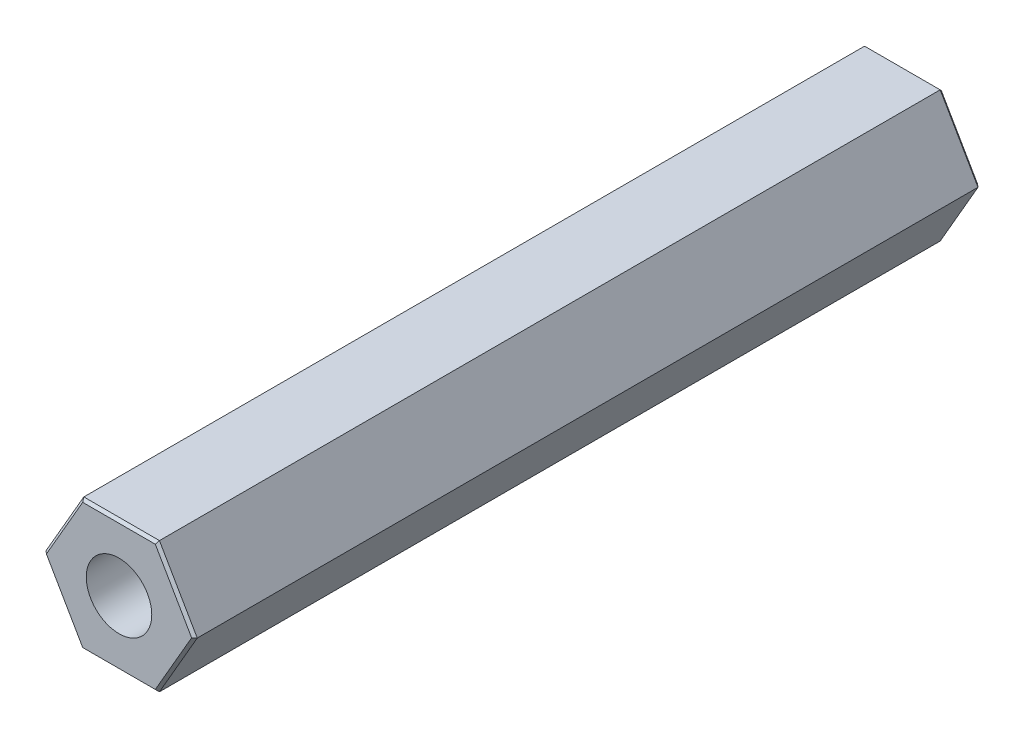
ISO-10303-21;
HEADER;
FILE_DESCRIPTION(('STEP AP214'),'2;1');
FILE_NAME('part.step','',(''),(''),'','','');
FILE_SCHEMA(('AUTOMOTIVE_DESIGN { 1 0 10303 214 1 1 1 1 }'));
ENDSEC;
DATA;
#1=APPLICATION_CONTEXT('core data for automotive mechanical design processes');
#2=APPLICATION_PROTOCOL_DEFINITION('international standard','automotive_design',2000,#1);
#3=PRODUCT_CONTEXT('',#1,'mechanical');
#4=PRODUCT('Part','Part','',(#3));
#5=PRODUCT_RELATED_PRODUCT_CATEGORY('part','',(#4));
#6=PRODUCT_DEFINITION_FORMATION('','',#4);
#7=PRODUCT_DEFINITION_CONTEXT('part definition',#1,'design');
#8=PRODUCT_DEFINITION('design','',#6,#7);
#9=PRODUCT_DEFINITION_SHAPE('','',#8);
#10=(LENGTH_UNIT() NAMED_UNIT(*) SI_UNIT(.MILLI.,.METRE.));
#11=(NAMED_UNIT(*) PLANE_ANGLE_UNIT() SI_UNIT($,.RADIAN.));
#12=(NAMED_UNIT(*) SI_UNIT($,.STERADIAN.) SOLID_ANGLE_UNIT());
#13=UNCERTAINTY_MEASURE_WITH_UNIT(LENGTH_MEASURE(1.E-05),#10,'distance_accuracy_value','');
#14=(GEOMETRIC_REPRESENTATION_CONTEXT(3) GLOBAL_UNCERTAINTY_ASSIGNED_CONTEXT((#13)) GLOBAL_UNIT_ASSIGNED_CONTEXT((#10,
#11,#12)) REPRESENTATION_CONTEXT('',''));
#15=CARTESIAN_POINT('',(0.,0.,0.));
#16=DIRECTION('',(0.,0.,1.));
#17=DIRECTION('',(1.,0.,0.));
#18=AXIS2_PLACEMENT_3D('',#15,#16,#17);
#19=CARTESIAN_POINT('',(2.88675134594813,0.,30.));
#20=DIRECTION('',(-0.866025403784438,-0.5,0.));
#21=DIRECTION('',(0.5,-0.866025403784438,0.));
#22=AXIS2_PLACEMENT_3D('',#19,#20,#21);
#23=PLANE('',#22);
#24=DIRECTION('',(0.,0.,-1.));
#25=VECTOR('',#24,1.);
#26=CARTESIAN_POINT('',(2.88675134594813,0.,30.));
#27=LINE('',#26,#25);
#28=CARTESIAN_POINT('',(2.88675134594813,0.,29.9));
#29=VERTEX_POINT('',#28);
#30=CARTESIAN_POINT('',(2.88675134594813,0.,0.0999999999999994));
#31=VERTEX_POINT('',#30);
#32=EDGE_CURVE('E237',#29,#31,#27,.T.);
#33=ORIENTED_EDGE('',*,*,#32,.T.);
#34=DIRECTION('',(-0.5,0.866025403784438,0.));
#35=VECTOR('',#34,1.);
#36=CARTESIAN_POINT('',(2.88675134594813,0.,0.0999999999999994));
#37=LINE('',#36,#35);
#38=CARTESIAN_POINT('',(1.44337567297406,2.5,0.0999999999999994));
#39=VERTEX_POINT('',#38);
#40=EDGE_CURVE('E278',#31,#39,#37,.T.);
#41=ORIENTED_EDGE('',*,*,#40,.T.);
#42=DIRECTION('',(0.,0.,-1.));
#43=VECTOR('',#42,1.);
#44=CARTESIAN_POINT('',(1.44337567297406,2.5,30.));
#45=LINE('',#44,#43);
#46=CARTESIAN_POINT('',(1.44337567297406,2.5,29.9));
#47=VERTEX_POINT('',#46);
#48=EDGE_CURVE('E272',#47,#39,#45,.T.);
#49=ORIENTED_EDGE('',*,*,#48,.F.);
#50=DIRECTION('',(0.5,-0.866025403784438,0.));
#51=VECTOR('',#50,1.);
#52=CARTESIAN_POINT('',(2.88675134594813,0.,29.9));
#53=LINE('',#52,#51);
#54=EDGE_CURVE('E275',#47,#29,#53,.T.);
#55=ORIENTED_EDGE('',*,*,#54,.T.);
#56=EDGE_LOOP('',(#33,#41,#49,#55));
#57=FACE_BOUND('',#56,.T.);
#58=ADVANCED_FACE('F42',(#57),#23,.F.);
#59=CARTESIAN_POINT('',(1.44337567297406,2.5,30.));
#60=DIRECTION('',(0.,-1.,0.));
#61=DIRECTION('',(1.,0.,0.));
#62=AXIS2_PLACEMENT_3D('',#59,#60,#61);
#63=PLANE('',#62);
#64=ORIENTED_EDGE('',*,*,#48,.T.);
#65=DIRECTION('',(-1.,0.,0.));
#66=VECTOR('',#65,1.);
#67=CARTESIAN_POINT('',(1.44337567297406,2.5,0.0999999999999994));
#68=LINE('',#67,#66);
#69=CARTESIAN_POINT('',(-1.44337567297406,2.5,0.0999999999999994));
#70=VERTEX_POINT('',#69);
#71=EDGE_CURVE('E201',#39,#70,#68,.T.);
#72=ORIENTED_EDGE('',*,*,#71,.T.);
#73=DIRECTION('',(0.,0.,-1.));
#74=VECTOR('',#73,1.);
#75=CARTESIAN_POINT('',(-1.44337567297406,2.5,30.));
#76=LINE('',#75,#74);
#77=CARTESIAN_POINT('',(-1.44337567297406,2.5,29.9));
#78=VERTEX_POINT('',#77);
#79=EDGE_CURVE('E269',#78,#70,#76,.T.);
#80=ORIENTED_EDGE('',*,*,#79,.F.);
#81=DIRECTION('',(1.,0.,0.));
#82=VECTOR('',#81,1.);
#83=CARTESIAN_POINT('',(1.44337567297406,2.5,29.9));
#84=LINE('',#83,#82);
#85=EDGE_CURVE('E199',#78,#47,#84,.T.);
#86=ORIENTED_EDGE('',*,*,#85,.T.);
#87=EDGE_LOOP('',(#64,#72,#80,#86));
#88=FACE_BOUND('',#87,.T.);
#89=ADVANCED_FACE('F84',(#88),#63,.F.);
#90=CARTESIAN_POINT('',(-1.44337567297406,2.5,30.));
#91=DIRECTION('',(0.866025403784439,-0.5,0.));
#92=DIRECTION('',(0.5,0.866025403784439,0.));
#93=AXIS2_PLACEMENT_3D('',#90,#91,#92);
#94=PLANE('',#93);
#95=ORIENTED_EDGE('',*,*,#79,.T.);
#96=DIRECTION('',(-0.5,-0.866025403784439,0.));
#97=VECTOR('',#96,1.);
#98=CARTESIAN_POINT('',(-1.44337567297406,2.5,0.0999999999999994));
#99=LINE('',#98,#97);
#100=CARTESIAN_POINT('',(-2.88675134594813,0.,0.0999999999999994));
#101=VERTEX_POINT('',#100);
#102=EDGE_CURVE('E196',#70,#101,#99,.T.);
#103=ORIENTED_EDGE('',*,*,#102,.T.);
#104=DIRECTION('',(0.,0.,-1.));
#105=VECTOR('',#104,1.);
#106=CARTESIAN_POINT('',(-2.88675134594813,0.,30.));
#107=LINE('',#106,#105);
#108=CARTESIAN_POINT('',(-2.88675134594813,0.,29.9));
#109=VERTEX_POINT('',#108);
#110=EDGE_CURVE('E266',#109,#101,#107,.T.);
#111=ORIENTED_EDGE('',*,*,#110,.F.);
#112=DIRECTION('',(0.5,0.866025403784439,0.));
#113=VECTOR('',#112,1.);
#114=CARTESIAN_POINT('',(-1.44337567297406,2.5,29.9));
#115=LINE('',#114,#113);
#116=EDGE_CURVE('E193',#109,#78,#115,.T.);
#117=ORIENTED_EDGE('',*,*,#116,.T.);
#118=EDGE_LOOP('',(#95,#103,#111,#117));
#119=FACE_BOUND('',#118,.T.);
#120=ADVANCED_FACE('F90',(#119),#94,.F.);
#121=CARTESIAN_POINT('',(-2.88675134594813,0.,30.));
#122=DIRECTION('',(0.866025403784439,0.5,0.));
#123=DIRECTION('',(-0.5,0.866025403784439,0.));
#124=AXIS2_PLACEMENT_3D('',#121,#122,#123);
#125=PLANE('',#124);
#126=ORIENTED_EDGE('',*,*,#110,.T.);
#127=DIRECTION('',(0.5,-0.866025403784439,0.));
#128=VECTOR('',#127,1.);
#129=CARTESIAN_POINT('',(-2.88675134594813,0.,0.0999999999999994));
#130=LINE('',#129,#128);
#131=CARTESIAN_POINT('',(-1.44337567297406,-2.5,0.0999999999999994));
#132=VERTEX_POINT('',#131);
#133=EDGE_CURVE('E190',#101,#132,#130,.T.);
#134=ORIENTED_EDGE('',*,*,#133,.T.);
#135=DIRECTION('',(0.,0.,-1.));
#136=VECTOR('',#135,1.);
#137=CARTESIAN_POINT('',(-1.44337567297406,-2.5,30.));
#138=LINE('',#137,#136);
#139=CARTESIAN_POINT('',(-1.44337567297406,-2.5,29.9));
#140=VERTEX_POINT('',#139);
#141=EDGE_CURVE('E264',#140,#132,#138,.T.);
#142=ORIENTED_EDGE('',*,*,#141,.F.);
#143=DIRECTION('',(-0.5,0.866025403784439,0.));
#144=VECTOR('',#143,1.);
#145=CARTESIAN_POINT('',(-2.88675134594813,0.,29.9));
#146=LINE('',#145,#144);
#147=EDGE_CURVE('E182',#140,#109,#146,.T.);
#148=ORIENTED_EDGE('',*,*,#147,.T.);
#149=EDGE_LOOP('',(#126,#134,#142,#148));
#150=FACE_BOUND('',#149,.T.);
#151=ADVANCED_FACE('F331',(#150),#125,.F.);
#152=CARTESIAN_POINT('',(-1.44337567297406,-2.5,30.));
#153=DIRECTION('',(0.,1.,0.));
#154=DIRECTION('',(0.,0.,1.));
#155=AXIS2_PLACEMENT_3D('',#152,#153,#154);
#156=PLANE('',#155);
#157=ORIENTED_EDGE('',*,*,#141,.T.);
#158=DIRECTION('',(1.,0.,0.));
#159=VECTOR('',#158,1.);
#160=CARTESIAN_POINT('',(-1.44337567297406,-2.5,0.0999999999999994));
#161=LINE('',#160,#159);
#162=CARTESIAN_POINT('',(1.44337567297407,-2.5,0.0999999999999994));
#163=VERTEX_POINT('',#162);
#164=EDGE_CURVE('E178',#132,#163,#161,.T.);
#165=ORIENTED_EDGE('',*,*,#164,.T.);
#166=DIRECTION('',(0.,0.,-1.));
#167=VECTOR('',#166,1.);
#168=CARTESIAN_POINT('',(1.44337567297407,-2.5,30.));
#169=LINE('',#168,#167);
#170=CARTESIAN_POINT('',(1.44337567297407,-2.5,29.9));
#171=VERTEX_POINT('',#170);
#172=EDGE_CURVE('E261',#171,#163,#169,.T.);
#173=ORIENTED_EDGE('',*,*,#172,.F.);
#174=DIRECTION('',(-1.,0.,0.));
#175=VECTOR('',#174,1.);
#176=CARTESIAN_POINT('',(-1.44337567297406,-2.5,29.9));
#177=LINE('',#176,#175);
#178=EDGE_CURVE('E169',#171,#140,#177,.T.);
#179=ORIENTED_EDGE('',*,*,#178,.T.);
#180=EDGE_LOOP('',(#157,#165,#173,#179));
#181=FACE_BOUND('',#180,.T.);
#182=ADVANCED_FACE('F302',(#181),#156,.F.);
#183=CARTESIAN_POINT('',(1.44337567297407,-2.5,30.));
#184=DIRECTION('',(-0.866025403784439,0.5,0.));
#185=DIRECTION('',(-0.5,-0.866025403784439,0.));
#186=AXIS2_PLACEMENT_3D('',#183,#184,#185);
#187=PLANE('',#186);
#188=ORIENTED_EDGE('',*,*,#172,.T.);
#189=DIRECTION('',(0.5,0.866025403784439,0.));
#190=VECTOR('',#189,1.);
#191=CARTESIAN_POINT('',(1.44337567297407,-2.5,0.0999999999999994));
#192=LINE('',#191,#190);
#193=EDGE_CURVE('E179',#163,#31,#192,.T.);
#194=ORIENTED_EDGE('',*,*,#193,.T.);
#195=ORIENTED_EDGE('',*,*,#32,.F.);
#196=DIRECTION('',(-0.5,-0.866025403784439,0.));
#197=VECTOR('',#196,1.);
#198=CARTESIAN_POINT('',(1.44337567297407,-2.5,29.9));
#199=LINE('',#198,#197);
#200=EDGE_CURVE('E156',#29,#171,#199,.T.);
#201=ORIENTED_EDGE('',*,*,#200,.T.);
#202=EDGE_LOOP('',(#188,#194,#195,#201));
#203=FACE_BOUND('',#202,.T.);
#204=ADVANCED_FACE('F300',(#203),#187,.F.);
#205=CARTESIAN_POINT('',(1.44337567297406,2.5,30.));
#206=DIRECTION('',(0.,0.,1.));
#207=DIRECTION('',(1.,0.,0.));
#208=AXIS2_PLACEMENT_3D('',#205,#206,#207);
#209=PLANE('',#208);
#210=CARTESIAN_POINT('',(0.,0.,30.));
#211=DIRECTION('',(0.,0.,1.));
#212=DIRECTION('',(1.,0.,0.));
#213=AXIS2_PLACEMENT_3D('',#210,#211,#212);
#214=CIRCLE('',#213,1.25);
#215=CARTESIAN_POINT('',(1.25,0.,30.));
#216=VERTEX_POINT('',#215);
#217=EDGE_CURVE('E255',#216,#216,#214,.T.);
#218=ORIENTED_EDGE('',*,*,#217,.F.);
#219=EDGE_LOOP('',(#218));
#220=FACE_BOUND('',#219,.T.);
#221=DIRECTION('',(-1.,0.,0.));
#222=VECTOR('',#221,1.);
#223=CARTESIAN_POINT('',(-1.44337567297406,2.4,30.));
#224=LINE('',#223,#222);
#225=CARTESIAN_POINT('',(1.3856406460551,2.4,30.));
#226=VERTEX_POINT('',#225);
#227=CARTESIAN_POINT('',(-1.3856406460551,2.4,30.));
#228=VERTEX_POINT('',#227);
#229=EDGE_CURVE('E204',#226,#228,#224,.T.);
#230=ORIENTED_EDGE('',*,*,#229,.T.);
#231=DIRECTION('',(-0.5,-0.866025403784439,0.));
#232=VECTOR('',#231,1.);
#233=CARTESIAN_POINT('',(-2.80014880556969,-0.0499999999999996,30.));
#234=LINE('',#233,#232);
#235=CARTESIAN_POINT('',(-2.77128129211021,0.,30.));
#236=VERTEX_POINT('',#235);
#237=EDGE_CURVE('E216',#228,#236,#234,.T.);
#238=ORIENTED_EDGE('',*,*,#237,.T.);
#239=DIRECTION('',(0.5,-0.866025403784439,0.));
#240=VECTOR('',#239,1.);
#241=CARTESIAN_POINT('',(-1.35677313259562,-2.45,30.));
#242=LINE('',#241,#240);
#243=CARTESIAN_POINT('',(-1.3856406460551,-2.4,30.));
#244=VERTEX_POINT('',#243);
#245=EDGE_CURVE('E214',#236,#244,#242,.T.);
#246=ORIENTED_EDGE('',*,*,#245,.T.);
#247=DIRECTION('',(1.,0.,0.));
#248=VECTOR('',#247,1.);
#249=CARTESIAN_POINT('',(1.44337567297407,-2.4,30.));
#250=LINE('',#249,#248);
#251=CARTESIAN_POINT('',(1.3856406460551,-2.4,30.));
#252=VERTEX_POINT('',#251);
#253=EDGE_CURVE('E211',#244,#252,#250,.T.);
#254=ORIENTED_EDGE('',*,*,#253,.T.);
#255=DIRECTION('',(0.5,0.866025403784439,0.));
#256=VECTOR('',#255,1.);
#257=CARTESIAN_POINT('',(2.80014880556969,0.0500000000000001,30.));
#258=LINE('',#257,#256);
#259=CARTESIAN_POINT('',(2.77128129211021,0.,30.));
#260=VERTEX_POINT('',#259);
#261=EDGE_CURVE('E159',#252,#260,#258,.T.);
#262=ORIENTED_EDGE('',*,*,#261,.T.);
#263=DIRECTION('',(-0.5,0.866025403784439,0.));
#264=VECTOR('',#263,1.);
#265=CARTESIAN_POINT('',(1.35677313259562,2.45,30.));
#266=LINE('',#265,#264);
#267=EDGE_CURVE('E207',#260,#226,#266,.T.);
#268=ORIENTED_EDGE('',*,*,#267,.T.);
#269=EDGE_LOOP('',(#230,#238,#246,#254,#262,#268));
#270=FACE_BOUND('',#269,.T.);
#271=ADVANCED_FACE('F329',(#220,#270),#209,.T.);
#272=CARTESIAN_POINT('',(1.44337567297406,2.5,0.));
#273=DIRECTION('',(0.,0.,1.));
#274=DIRECTION('',(1.,0.,0.));
#275=AXIS2_PLACEMENT_3D('',#272,#273,#274);
#276=PLANE('',#275);
#277=CARTESIAN_POINT('',(0.,0.,0.));
#278=DIRECTION('',(0.,0.,-1.));
#279=DIRECTION('',(-1.,0.,0.));
#280=AXIS2_PLACEMENT_3D('',#277,#278,#279);
#281=CIRCLE('',#280,1.25);
#282=CARTESIAN_POINT('',(-1.25,0.,0.));
#283=VERTEX_POINT('',#282);
#284=EDGE_CURVE('E240',#283,#283,#281,.T.);
#285=ORIENTED_EDGE('',*,*,#284,.F.);
#286=EDGE_LOOP('',(#285));
#287=FACE_BOUND('',#286,.T.);
#288=DIRECTION('',(1.,0.,0.));
#289=VECTOR('',#288,1.);
#290=CARTESIAN_POINT('',(1.44337567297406,2.4,0.));
#291=LINE('',#290,#289);
#292=CARTESIAN_POINT('',(-1.3856406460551,2.4,0.));
#293=VERTEX_POINT('',#292);
#294=CARTESIAN_POINT('',(1.3856406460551,2.4,0.));
#295=VERTEX_POINT('',#294);
#296=EDGE_CURVE('E281',#293,#295,#291,.T.);
#297=ORIENTED_EDGE('',*,*,#296,.T.);
#298=DIRECTION('',(0.5,-0.866025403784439,0.));
#299=VECTOR('',#298,1.);
#300=CARTESIAN_POINT('',(1.35677313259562,2.45,0.));
#301=LINE('',#300,#299);
#302=CARTESIAN_POINT('',(2.77128129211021,0.,0.));
#303=VERTEX_POINT('',#302);
#304=EDGE_CURVE('E296',#295,#303,#301,.T.);
#305=ORIENTED_EDGE('',*,*,#304,.T.);
#306=DIRECTION('',(-0.5,-0.866025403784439,0.));
#307=VECTOR('',#306,1.);
#308=CARTESIAN_POINT('',(3.52183664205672,1.3,0.));
#309=LINE('',#308,#307);
#310=CARTESIAN_POINT('',(1.3856406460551,-2.4,0.));
#311=VERTEX_POINT('',#310);
#312=EDGE_CURVE('E293',#303,#311,#309,.T.);
#313=ORIENTED_EDGE('',*,*,#312,.T.);
#314=DIRECTION('',(-1.,0.,0.));
#315=VECTOR('',#314,1.);
#316=CARTESIAN_POINT('',(1.44337567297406,-2.4,0.));
#317=LINE('',#316,#315);
#318=CARTESIAN_POINT('',(-1.3856406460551,-2.4,0.));
#319=VERTEX_POINT('',#318);
#320=EDGE_CURVE('E290',#311,#319,#317,.T.);
#321=ORIENTED_EDGE('',*,*,#320,.T.);
#322=DIRECTION('',(-0.5,0.866025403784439,0.));
#323=VECTOR('',#322,1.);
#324=CARTESIAN_POINT('',(-2.80014880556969,0.0499999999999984,0.));
#325=LINE('',#324,#323);
#326=CARTESIAN_POINT('',(-2.77128129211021,0.,0.));
#327=VERTEX_POINT('',#326);
#328=EDGE_CURVE('E287',#319,#327,#325,.T.);
#329=ORIENTED_EDGE('',*,*,#328,.T.);
#330=DIRECTION('',(0.5,0.866025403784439,0.));
#331=VECTOR('',#330,1.);
#332=CARTESIAN_POINT('',(-0.635085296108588,3.7,0.));
#333=LINE('',#332,#331);
#334=EDGE_CURVE('E284',#327,#293,#333,.T.);
#335=ORIENTED_EDGE('',*,*,#334,.T.);
#336=EDGE_LOOP('',(#297,#305,#313,#321,#329,#335));
#337=FACE_BOUND('',#336,.T.);
#338=ADVANCED_FACE('F120',(#287,#337),#276,.F.);
#339=CARTESIAN_POINT('',(-2.88675134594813,0.,0.0999999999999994));
#340=DIRECTION('',(0.612372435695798,0.353553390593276,0.707106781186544));
#341=DIRECTION('',(0.755928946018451,0.,-0.654653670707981));
#342=AXIS2_PLACEMENT_3D('',#339,#340,#341);
#343=PLANE('',#342);
#344=DIRECTION('',(-0.755928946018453,0.,0.654653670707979));
#345=VECTOR('',#344,1.);
#346=CARTESIAN_POINT('',(-2.06196524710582,0.,-0.614285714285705));
#347=LINE('',#346,#345);
#348=EDGE_CURVE('E231',#327,#101,#347,.T.);
#349=ORIENTED_EDGE('',*,*,#348,.F.);
#350=ORIENTED_EDGE('',*,*,#328,.F.);
#351=DIRECTION('',(-0.37796447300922,-0.654653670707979,0.654653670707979));
#352=VECTOR('',#351,1.);
#353=CARTESIAN_POINT('',(-1.03098262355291,-1.78571428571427,-0.614285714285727));
#354=LINE('',#353,#352);
#355=EDGE_CURVE('E234',#132,#319,#354,.F.);
#356=ORIENTED_EDGE('',*,*,#355,.F.);
#357=ORIENTED_EDGE('',*,*,#133,.F.);
#358=EDGE_LOOP('',(#349,#350,#356,#357));
#359=FACE_BOUND('',#358,.T.);
#360=ADVANCED_FACE('F116',(#359),#343,.F.);
#361=CARTESIAN_POINT('',(-1.44337567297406,-2.5,0.0999999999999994));
#362=DIRECTION('',(0.,0.707106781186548,0.707106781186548));
#363=DIRECTION('',(0.,-0.707106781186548,0.707106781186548));
#364=AXIS2_PLACEMENT_3D('',#361,#362,#363);
#365=PLANE('',#364);
#366=ORIENTED_EDGE('',*,*,#355,.T.);
#367=ORIENTED_EDGE('',*,*,#320,.F.);
#368=DIRECTION('',(0.377964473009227,-0.654653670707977,0.654653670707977));
#369=VECTOR('',#368,1.);
#370=CARTESIAN_POINT('',(1.0309826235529,-1.78571428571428,-0.614285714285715));
#371=LINE('',#370,#369);
#372=EDGE_CURVE('E228',#163,#311,#371,.F.);
#373=ORIENTED_EDGE('',*,*,#372,.F.);
#374=ORIENTED_EDGE('',*,*,#164,.F.);
#375=EDGE_LOOP('',(#366,#367,#373,#374));
#376=FACE_BOUND('',#375,.T.);
#377=ADVANCED_FACE('F112',(#376),#365,.F.);
#378=CARTESIAN_POINT('',(-1.44337567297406,2.5,0.0999999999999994));
#379=DIRECTION('',(0.612372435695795,-0.353553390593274,0.707106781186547));
#380=DIRECTION('',(0.755928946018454,0.,-0.654653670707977));
#381=AXIS2_PLACEMENT_3D('',#378,#379,#380);
#382=PLANE('',#381);
#383=ORIENTED_EDGE('',*,*,#348,.T.);
#384=ORIENTED_EDGE('',*,*,#102,.F.);
#385=DIRECTION('',(-0.377964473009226,0.654653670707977,0.654653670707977));
#386=VECTOR('',#385,1.);
#387=CARTESIAN_POINT('',(-1.0309826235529,1.78571428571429,-0.614285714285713));
#388=LINE('',#387,#386);
#389=EDGE_CURVE('E225',#293,#70,#388,.T.);
#390=ORIENTED_EDGE('',*,*,#389,.F.);
#391=ORIENTED_EDGE('',*,*,#334,.F.);
#392=EDGE_LOOP('',(#383,#384,#390,#391));
#393=FACE_BOUND('',#392,.T.);
#394=ADVANCED_FACE('F108',(#393),#382,.F.);
#395=CARTESIAN_POINT('',(1.44337567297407,-2.5,0.0999999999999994));
#396=DIRECTION('',(-0.612372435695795,0.353553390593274,0.707106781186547));
#397=DIRECTION('',(0.755928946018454,0.,0.654653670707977));
#398=AXIS2_PLACEMENT_3D('',#395,#396,#397);
#399=PLANE('',#398);
#400=ORIENTED_EDGE('',*,*,#372,.T.);
#401=ORIENTED_EDGE('',*,*,#312,.F.);
#402=DIRECTION('',(0.755928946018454,0.,0.654653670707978));
#403=VECTOR('',#402,1.);
#404=CARTESIAN_POINT('',(2.06196524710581,0.,-0.614285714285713));
#405=LINE('',#404,#403);
#406=EDGE_CURVE('E222',#31,#303,#405,.F.);
#407=ORIENTED_EDGE('',*,*,#406,.F.);
#408=ORIENTED_EDGE('',*,*,#193,.F.);
#409=EDGE_LOOP('',(#400,#401,#407,#408));
#410=FACE_BOUND('',#409,.T.);
#411=ADVANCED_FACE('F104',(#410),#399,.F.);
#412=CARTESIAN_POINT('',(1.44337567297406,2.5,0.0999999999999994));
#413=DIRECTION('',(0.,-0.707106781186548,0.707106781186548));
#414=DIRECTION('',(0.,-0.707106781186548,-0.707106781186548));
#415=AXIS2_PLACEMENT_3D('',#412,#413,#414);
#416=PLANE('',#415);
#417=ORIENTED_EDGE('',*,*,#389,.T.);
#418=ORIENTED_EDGE('',*,*,#71,.F.);
#419=DIRECTION('',(-0.377964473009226,-0.654653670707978,-0.654653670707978));
#420=VECTOR('',#419,1.);
#421=CARTESIAN_POINT('',(1.44337567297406,2.5,0.0999999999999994));
#422=LINE('',#421,#420);
#423=EDGE_CURVE('E219',#295,#39,#422,.F.);
#424=ORIENTED_EDGE('',*,*,#423,.F.);
#425=ORIENTED_EDGE('',*,*,#296,.F.);
#426=EDGE_LOOP('',(#417,#418,#424,#425));
#427=FACE_BOUND('',#426,.T.);
#428=ADVANCED_FACE('F100',(#427),#416,.F.);
#429=CARTESIAN_POINT('',(2.88675134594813,0.,0.0999999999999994));
#430=DIRECTION('',(-0.612372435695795,-0.353553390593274,0.707106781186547));
#431=DIRECTION('',(0.755928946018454,0.,0.654653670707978));
#432=AXIS2_PLACEMENT_3D('',#429,#430,#431);
#433=PLANE('',#432);
#434=ORIENTED_EDGE('',*,*,#406,.T.);
#435=ORIENTED_EDGE('',*,*,#304,.F.);
#436=ORIENTED_EDGE('',*,*,#423,.T.);
#437=ORIENTED_EDGE('',*,*,#40,.F.);
#438=EDGE_LOOP('',(#434,#435,#436,#437));
#439=FACE_BOUND('',#438,.T.);
#440=ADVANCED_FACE('F96',(#439),#433,.F.);
#441=CARTESIAN_POINT('',(3.52183664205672,1.3,30.));
#442=DIRECTION('',(0.612372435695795,-0.353553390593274,0.707106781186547));
#443=DIRECTION('',(0.755928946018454,0.,-0.654653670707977));
#444=AXIS2_PLACEMENT_3D('',#441,#442,#443);
#445=PLANE('',#444);
#446=DIRECTION('',(0.377964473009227,-0.654653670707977,-0.654653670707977));
#447=VECTOR('',#446,1.);
#448=CARTESIAN_POINT('',(0.775298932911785,-1.34285714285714,31.0571428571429));
#449=LINE('',#448,#447);
#450=EDGE_CURVE('E151',#171,#252,#449,.F.);
#451=ORIENTED_EDGE('',*,*,#450,.F.);
#452=ORIENTED_EDGE('',*,*,#200,.F.);
#453=DIRECTION('',(0.755928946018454,0.,-0.654653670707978));
#454=VECTOR('',#453,1.);
#455=CARTESIAN_POINT('',(1.96299091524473,0.,30.7));
#456=LINE('',#455,#454);
#457=EDGE_CURVE('E164',#260,#29,#456,.T.);
#458=ORIENTED_EDGE('',*,*,#457,.F.);
#459=ORIENTED_EDGE('',*,*,#261,.F.);
#460=EDGE_LOOP('',(#451,#452,#458,#459));
#461=FACE_BOUND('',#460,.T.);
#462=ADVANCED_FACE('F99',(#461),#445,.T.);
#463=CARTESIAN_POINT('',(1.35677313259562,2.45,30.));
#464=DIRECTION('',(0.612372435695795,0.353553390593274,0.707106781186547));
#465=DIRECTION('',(0.755928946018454,0.,-0.654653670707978));
#466=AXIS2_PLACEMENT_3D('',#463,#464,#465);
#467=PLANE('',#466);
#468=ORIENTED_EDGE('',*,*,#457,.T.);
#469=ORIENTED_EDGE('',*,*,#54,.F.);
#470=DIRECTION('',(0.377964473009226,0.654653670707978,-0.654653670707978));
#471=VECTOR('',#470,1.);
#472=CARTESIAN_POINT('',(1.39388850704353,2.41428571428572,29.9857142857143));
#473=LINE('',#472,#471);
#474=EDGE_CURVE('E165',#226,#47,#473,.T.);
#475=ORIENTED_EDGE('',*,*,#474,.F.);
#476=ORIENTED_EDGE('',*,*,#267,.F.);
#477=EDGE_LOOP('',(#468,#469,#475,#476));
#478=FACE_BOUND('',#477,.T.);
#479=ADVANCED_FACE('F137',(#478),#467,.T.);
#480=CARTESIAN_POINT('',(1.44337567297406,-2.4,30.));
#481=DIRECTION('',(0.,-0.707106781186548,0.707106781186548));
#482=DIRECTION('',(0.,-0.707106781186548,-0.707106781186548));
#483=AXIS2_PLACEMENT_3D('',#480,#481,#482);
#484=PLANE('',#483);
#485=ORIENTED_EDGE('',*,*,#450,.T.);
#486=ORIENTED_EDGE('',*,*,#253,.F.);
#487=DIRECTION('',(-0.37796447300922,-0.654653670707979,-0.654653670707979));
#488=VECTOR('',#487,1.);
#489=CARTESIAN_POINT('',(-0.981495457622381,-1.70000000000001,30.7));
#490=LINE('',#489,#488);
#491=EDGE_CURVE('E172',#140,#244,#490,.F.);
#492=ORIENTED_EDGE('',*,*,#491,.F.);
#493=ORIENTED_EDGE('',*,*,#178,.F.);
#494=EDGE_LOOP('',(#485,#486,#492,#493));
#495=FACE_BOUND('',#494,.T.);
#496=ADVANCED_FACE('F133',(#495),#484,.T.);
#497=CARTESIAN_POINT('',(1.44337567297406,2.4,30.));
#498=DIRECTION('',(0.,0.707106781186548,0.707106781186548));
#499=DIRECTION('',(0.,-0.707106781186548,0.707106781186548));
#500=AXIS2_PLACEMENT_3D('',#497,#498,#499);
#501=PLANE('',#500);
#502=ORIENTED_EDGE('',*,*,#474,.T.);
#503=ORIENTED_EDGE('',*,*,#85,.F.);
#504=DIRECTION('',(0.377964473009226,-0.654653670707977,0.654653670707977));
#505=VECTOR('',#504,1.);
#506=CARTESIAN_POINT('',(-0.981495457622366,1.7,30.7));
#507=LINE('',#506,#505);
#508=EDGE_CURVE('E239',#228,#78,#507,.F.);
#509=ORIENTED_EDGE('',*,*,#508,.F.);
#510=ORIENTED_EDGE('',*,*,#229,.F.);
#511=EDGE_LOOP('',(#502,#503,#509,#510));
#512=FACE_BOUND('',#511,.T.);
#513=ADVANCED_FACE('F129',(#512),#501,.T.);
#514=CARTESIAN_POINT('',(-2.80014880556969,0.0499999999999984,30.));
#515=DIRECTION('',(-0.612372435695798,-0.353553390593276,0.707106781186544));
#516=DIRECTION('',(0.755928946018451,0.,0.654653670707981));
#517=AXIS2_PLACEMENT_3D('',#514,#515,#516);
#518=PLANE('',#517);
#519=ORIENTED_EDGE('',*,*,#491,.T.);
#520=ORIENTED_EDGE('',*,*,#245,.F.);
#521=DIRECTION('',(-0.755928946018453,0.,-0.654653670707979));
#522=VECTOR('',#521,1.);
#523=CARTESIAN_POINT('',(-2.78777701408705,0.,29.9857142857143));
#524=LINE('',#523,#522);
#525=EDGE_CURVE('E59',#109,#236,#524,.F.);
#526=ORIENTED_EDGE('',*,*,#525,.F.);
#527=ORIENTED_EDGE('',*,*,#147,.F.);
#528=EDGE_LOOP('',(#519,#520,#526,#527));
#529=FACE_BOUND('',#528,.T.);
#530=ADVANCED_FACE('F126',(#529),#518,.T.);
#531=CARTESIAN_POINT('',(-0.635085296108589,3.7,30.));
#532=DIRECTION('',(-0.612372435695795,0.353553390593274,0.707106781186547));
#533=DIRECTION('',(0.755928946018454,0.,0.654653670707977));
#534=AXIS2_PLACEMENT_3D('',#531,#532,#533);
#535=PLANE('',#534);
#536=ORIENTED_EDGE('',*,*,#508,.T.);
#537=ORIENTED_EDGE('',*,*,#116,.F.);
#538=ORIENTED_EDGE('',*,*,#525,.T.);
#539=ORIENTED_EDGE('',*,*,#237,.F.);
#540=EDGE_LOOP('',(#536,#537,#538,#539));
#541=FACE_BOUND('',#540,.T.);
#542=ADVANCED_FACE('F122',(#541),#535,.T.);
#543=CARTESIAN_POINT('',(0.,0.,12.));
#544=DIRECTION('',(0.,0.,-1.));
#545=DIRECTION('',(-1.,0.,0.));
#546=AXIS2_PLACEMENT_3D('',#543,#544,#545);
#547=CYLINDRICAL_SURFACE('',#546,1.25);
#548=CARTESIAN_POINT('',(0.,0.,10.75));
#549=DIRECTION('',(0.,0.,-1.));
#550=DIRECTION('',(-1.,0.,0.));
#551=AXIS2_PLACEMENT_3D('',#548,#549,#550);
#552=CIRCLE('',#551,1.25);
#553=CARTESIAN_POINT('',(-1.25,0.,10.75));
#554=VERTEX_POINT('',#553);
#555=EDGE_CURVE('E51',#554,#554,#552,.F.);
#556=ORIENTED_EDGE('',*,*,#555,.T.);
#557=EDGE_LOOP('',(#556));
#558=FACE_BOUND('',#557,.T.);
#559=ORIENTED_EDGE('',*,*,#284,.T.);
#560=EDGE_LOOP('',(#559));
#561=FACE_BOUND('',#560,.T.);
#562=ADVANCED_FACE('F125',(#558,#561),#547,.F.);
#563=CARTESIAN_POINT('',(0.,0.,18.));
#564=DIRECTION('',(0.,0.,1.));
#565=DIRECTION('',(1.,0.,0.));
#566=AXIS2_PLACEMENT_3D('',#563,#564,#565);
#567=CYLINDRICAL_SURFACE('',#566,1.25);
#568=CARTESIAN_POINT('',(0.,0.,19.25));
#569=DIRECTION('',(0.,0.,1.));
#570=DIRECTION('',(1.,0.,0.));
#571=AXIS2_PLACEMENT_3D('',#568,#569,#570);
#572=CIRCLE('',#571,1.25);
#573=CARTESIAN_POINT('',(1.25,0.,19.25));
#574=VERTEX_POINT('',#573);
#575=EDGE_CURVE('E12',#574,#574,#572,.F.);
#576=ORIENTED_EDGE('',*,*,#575,.T.);
#577=EDGE_LOOP('',(#576));
#578=FACE_BOUND('',#577,.T.);
#579=ORIENTED_EDGE('',*,*,#217,.T.);
#580=EDGE_LOOP('',(#579));
#581=FACE_BOUND('',#580,.T.);
#582=ADVANCED_FACE('F80',(#578,#581),#567,.F.);
#583=CARTESIAN_POINT('',(0.,0.,10.75));
#584=DIRECTION('',(0.,0.,-1.));
#585=DIRECTION('',(-1.,0.,0.));
#586=AXIS2_PLACEMENT_3D('',#583,#584,#585);
#587=CONICAL_SURFACE('',#586,1.25000000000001,0.785398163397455);
#588=ORIENTED_EDGE('',*,*,#555,.F.);
#589=EDGE_LOOP('',(#588));
#590=FACE_BOUND('',#589,.T.);
#591=CARTESIAN_POINT('',(0.,0.,12.));
#592=VERTEX_POINT('',#591);
#593=VERTEX_LOOP('',#592);
#594=FACE_BOUND('',#593,.T.);
#595=ADVANCED_FACE('F75',(#590,#594),#587,.F.);
#596=CARTESIAN_POINT('',(0.,0.,19.25));
#597=DIRECTION('',(0.,0.,1.));
#598=DIRECTION('',(1.,0.,0.));
#599=AXIS2_PLACEMENT_3D('',#596,#597,#598);
#600=CONICAL_SURFACE('',#599,1.25000000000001,0.785398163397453);
#601=ORIENTED_EDGE('',*,*,#575,.F.);
#602=EDGE_LOOP('',(#601));
#603=FACE_BOUND('',#602,.T.);
#604=CARTESIAN_POINT('',(0.,0.,18.));
#605=VERTEX_POINT('',#604);
#606=VERTEX_LOOP('',#605);
#607=FACE_BOUND('',#606,.T.);
#608=ADVANCED_FACE('F44',(#603,#607),#600,.F.);
#609=CLOSED_SHELL('',(#58,#89,#120,#151,#182,#204,#271,#338,#360,#377,#394,#411,#428,#440,#462,
#479,#496,#513,#530,#542,#562,#582,#595,#608));
#610=MANIFOLD_SOLID_BREP('B2',#609);
#611=ADVANCED_BREP_SHAPE_REPRESENTATION('',(#18,#610),#14);
#612=SHAPE_DEFINITION_REPRESENTATION(#9,#611);
ENDSEC;
END-ISO-10303-21;
